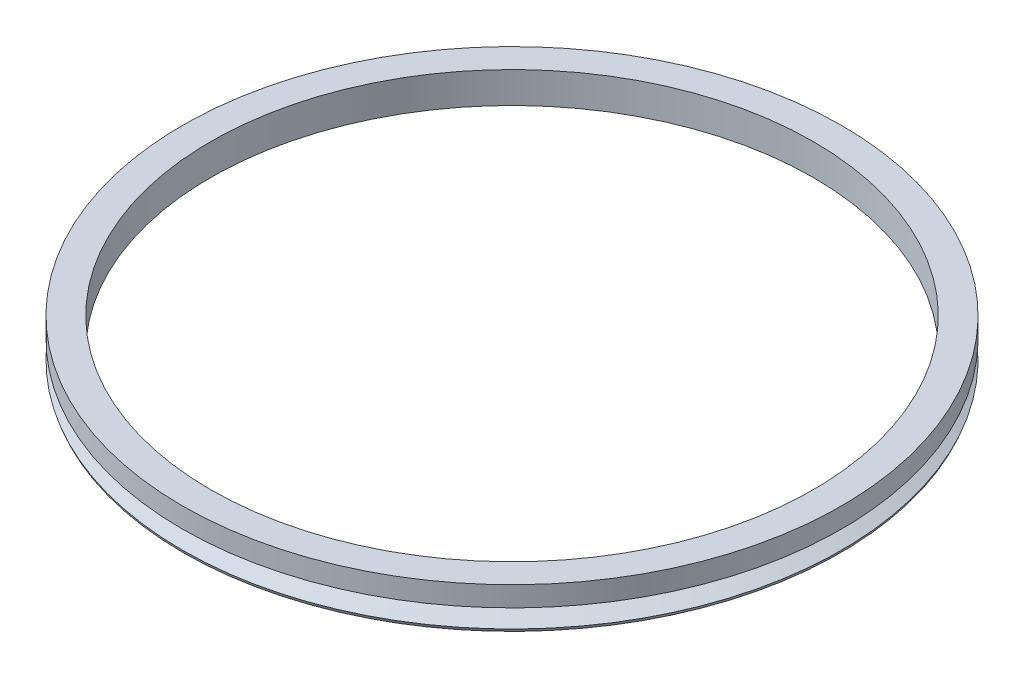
ISO-10303-21;
HEADER;
FILE_DESCRIPTION(('STEP AP214'),'2;1');
FILE_NAME('part.step','',(''),(''),'','','');
FILE_SCHEMA(('AUTOMOTIVE_DESIGN { 1 0 10303 214 1 1 1 1 }'));
ENDSEC;
DATA;
#1=APPLICATION_CONTEXT('core data for automotive mechanical design processes');
#2=APPLICATION_PROTOCOL_DEFINITION('international standard','automotive_design',2000,#1);
#3=PRODUCT_CONTEXT('',#1,'mechanical');
#4=PRODUCT('Part','Part','',(#3));
#5=PRODUCT_RELATED_PRODUCT_CATEGORY('part','',(#4));
#6=PRODUCT_DEFINITION_FORMATION('','',#4);
#7=PRODUCT_DEFINITION_CONTEXT('part definition',#1,'design');
#8=PRODUCT_DEFINITION('design','',#6,#7);
#9=PRODUCT_DEFINITION_SHAPE('','',#8);
#10=(LENGTH_UNIT() NAMED_UNIT(*) SI_UNIT(.MILLI.,.METRE.));
#11=(NAMED_UNIT(*) PLANE_ANGLE_UNIT() SI_UNIT($,.RADIAN.));
#12=(NAMED_UNIT(*) SI_UNIT($,.STERADIAN.) SOLID_ANGLE_UNIT());
#13=UNCERTAINTY_MEASURE_WITH_UNIT(LENGTH_MEASURE(1.E-05),#10,'distance_accuracy_value','');
#14=(GEOMETRIC_REPRESENTATION_CONTEXT(3) GLOBAL_UNCERTAINTY_ASSIGNED_CONTEXT((#13)) GLOBAL_UNIT_ASSIGNED_CONTEXT((#10,
#11,#12)) REPRESENTATION_CONTEXT('',''));
#15=CARTESIAN_POINT('',(0.,0.,0.));
#16=DIRECTION('',(0.,0.,1.));
#17=DIRECTION('',(1.,0.,0.));
#18=AXIS2_PLACEMENT_3D('',#15,#16,#17);
#19=CARTESIAN_POINT('',(0.,0.,0.));
#20=DIRECTION('',(0.,-1.,0.));
#21=DIRECTION('',(0.,0.,-1.));
#22=AXIS2_PLACEMENT_3D('',#19,#20,#21);
#23=CYLINDRICAL_SURFACE('',#22,76.2);
#24=CARTESIAN_POINT('',(0.,2.54,0.));
#25=DIRECTION('',(0.,-1.,0.));
#26=DIRECTION('',(0.,0.,-1.));
#27=AXIS2_PLACEMENT_3D('',#24,#25,#26);
#28=CIRCLE('',#27,76.2);
#29=CARTESIAN_POINT('',(0.,2.54,-76.2));
#30=VERTEX_POINT('',#29);
#31=EDGE_CURVE('E60',#30,#30,#28,.T.);
#32=ORIENTED_EDGE('',*,*,#31,.T.);
#33=EDGE_LOOP('',(#32));
#34=FACE_BOUND('',#33,.T.);
#35=CARTESIAN_POINT('',(0.,10.414,0.));
#36=DIRECTION('',(0.,-1.,0.));
#37=DIRECTION('',(0.,0.,-1.));
#38=AXIS2_PLACEMENT_3D('',#35,#36,#37);
#39=CIRCLE('',#38,76.2);
#40=CARTESIAN_POINT('',(0.,10.414,-76.2));
#41=VERTEX_POINT('',#40);
#42=EDGE_CURVE('E10',#41,#41,#39,.T.);
#43=ORIENTED_EDGE('',*,*,#42,.F.);
#44=EDGE_LOOP('',(#43));
#45=FACE_BOUND('',#44,.T.);
#46=ADVANCED_FACE('F35',(#34,#45),#23,.F.);
#47=CARTESIAN_POINT('',(83.312,10.414,0.));
#48=DIRECTION('',(0.,1.,0.));
#49=DIRECTION('',(0.,0.,1.));
#50=AXIS2_PLACEMENT_3D('',#47,#48,#49);
#51=PLANE('',#50);
#52=ORIENTED_EDGE('',*,*,#42,.T.);
#53=EDGE_LOOP('',(#52));
#54=FACE_BOUND('',#53,.T.);
#55=CARTESIAN_POINT('',(0.,10.414,0.));
#56=DIRECTION('',(0.,-1.,0.));
#57=DIRECTION('',(0.,0.,-1.));
#58=AXIS2_PLACEMENT_3D('',#55,#56,#57);
#59=CIRCLE('',#58,83.312);
#60=CARTESIAN_POINT('',(0.,10.414,-83.312));
#61=VERTEX_POINT('',#60);
#62=EDGE_CURVE('E41',#61,#61,#59,.T.);
#63=ORIENTED_EDGE('',*,*,#62,.F.);
#64=EDGE_LOOP('',(#63));
#65=FACE_BOUND('',#64,.T.);
#66=ADVANCED_FACE('F78',(#54,#65),#51,.T.);
#67=CARTESIAN_POINT('',(0.,0.,0.));
#68=DIRECTION('',(0.,-1.,0.));
#69=DIRECTION('',(0.,0.,-1.));
#70=AXIS2_PLACEMENT_3D('',#67,#68,#69);
#71=CYLINDRICAL_SURFACE('',#70,83.312);
#72=ORIENTED_EDGE('',*,*,#62,.T.);
#73=EDGE_LOOP('',(#72));
#74=FACE_BOUND('',#73,.T.);
#75=CARTESIAN_POINT('',(0.,5.334,0.));
#76=DIRECTION('',(0.,-1.,0.));
#77=DIRECTION('',(0.,0.,-1.));
#78=AXIS2_PLACEMENT_3D('',#75,#76,#77);
#79=CIRCLE('',#78,83.312);
#80=CARTESIAN_POINT('',(0.,5.334,-83.312));
#81=VERTEX_POINT('',#80);
#82=EDGE_CURVE('E45',#81,#81,#79,.T.);
#83=ORIENTED_EDGE('',*,*,#82,.F.);
#84=EDGE_LOOP('',(#83));
#85=FACE_BOUND('',#84,.T.);
#86=ADVANCED_FACE('F82',(#74,#85),#71,.T.);
#87=CARTESIAN_POINT('',(0.,3.302,0.));
#88=DIRECTION('',(0.,1.,0.));
#89=DIRECTION('',(0.,0.,1.));
#90=AXIS2_PLACEMENT_3D('',#87,#88,#89);
#91=CONICAL_SURFACE('',#90,78.232,1.19028994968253);
#92=ORIENTED_EDGE('',*,*,#82,.T.);
#93=EDGE_LOOP('',(#92));
#94=FACE_BOUND('',#93,.T.);
#95=CARTESIAN_POINT('',(0.,3.302,0.));
#96=DIRECTION('',(0.,-1.,0.));
#97=DIRECTION('',(0.,0.,-1.));
#98=AXIS2_PLACEMENT_3D('',#95,#96,#97);
#99=CIRCLE('',#98,78.232);
#100=CARTESIAN_POINT('',(0.,3.302,-78.232));
#101=VERTEX_POINT('',#100);
#102=EDGE_CURVE('E49',#101,#101,#99,.T.);
#103=ORIENTED_EDGE('',*,*,#102,.F.);
#104=EDGE_LOOP('',(#103));
#105=FACE_BOUND('',#104,.T.);
#106=ADVANCED_FACE('F86',(#94,#105),#91,.T.);
#107=CARTESIAN_POINT('',(0.,0.714425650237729,0.));
#108=DIRECTION('',(0.,-1.,0.));
#109=DIRECTION('',(0.,0.,-1.));
#110=AXIS2_PLACEMENT_3D('',#107,#108,#109);
#111=CONICAL_SURFACE('',#110,83.312,1.09968479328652);
#112=ORIENTED_EDGE('',*,*,#102,.T.);
#113=EDGE_LOOP('',(#112));
#114=FACE_BOUND('',#113,.T.);
#115=CARTESIAN_POINT('',(0.,0.714425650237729,0.));
#116=DIRECTION('',(0.,-1.,0.));
#117=DIRECTION('',(0.,0.,-1.));
#118=AXIS2_PLACEMENT_3D('',#115,#116,#117);
#119=CIRCLE('',#118,83.312);
#120=CARTESIAN_POINT('',(0.,0.714425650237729,-83.312));
#121=VERTEX_POINT('',#120);
#122=EDGE_CURVE('E54',#121,#121,#119,.T.);
#123=ORIENTED_EDGE('',*,*,#122,.F.);
#124=EDGE_LOOP('',(#123));
#125=FACE_BOUND('',#124,.T.);
#126=ADVANCED_FACE('F74',(#114,#125),#111,.T.);
#127=CARTESIAN_POINT('',(0.,0.,0.));
#128=DIRECTION('',(0.,1.,0.));
#129=DIRECTION('',(0.,0.,1.));
#130=AXIS2_PLACEMENT_3D('',#127,#128,#129);
#131=CONICAL_SURFACE('',#130,83.0469717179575,0.355230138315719);
#132=ORIENTED_EDGE('',*,*,#122,.T.);
#133=EDGE_LOOP('',(#132));
#134=FACE_BOUND('',#133,.T.);
#135=CARTESIAN_POINT('',(0.,0.,0.));
#136=DIRECTION('',(0.,-1.,0.));
#137=DIRECTION('',(0.,0.,-1.));
#138=AXIS2_PLACEMENT_3D('',#135,#136,#137);
#139=CIRCLE('',#138,83.0469717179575);
#140=CARTESIAN_POINT('',(0.,0.,-83.0469717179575));
#141=VERTEX_POINT('',#140);
#142=EDGE_CURVE('E57',#141,#141,#139,.T.);
#143=ORIENTED_EDGE('',*,*,#142,.F.);
#144=EDGE_LOOP('',(#143));
#145=FACE_BOUND('',#144,.T.);
#146=ADVANCED_FACE('F68',(#134,#145),#131,.T.);
#147=CARTESIAN_POINT('',(0.,2.54,0.));
#148=DIRECTION('',(0.,-1.,0.));
#149=DIRECTION('',(0.,0.,-1.));
#150=AXIS2_PLACEMENT_3D('',#147,#148,#149);
#151=CONICAL_SURFACE('',#150,76.2,1.21556618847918);
#152=ORIENTED_EDGE('',*,*,#142,.T.);
#153=EDGE_LOOP('',(#152));
#154=FACE_BOUND('',#153,.T.);
#155=ORIENTED_EDGE('',*,*,#31,.F.);
#156=EDGE_LOOP('',(#155));
#157=FACE_BOUND('',#156,.T.);
#158=ADVANCED_FACE('F66',(#154,#157),#151,.F.);
#159=CLOSED_SHELL('',(#46,#66,#86,#106,#126,#146,#158));
#160=MANIFOLD_SOLID_BREP('B2',#159);
#161=ADVANCED_BREP_SHAPE_REPRESENTATION('',(#18,#160),#14);
#162=SHAPE_DEFINITION_REPRESENTATION(#9,#161);
ENDSEC;
END-ISO-10303-21;
